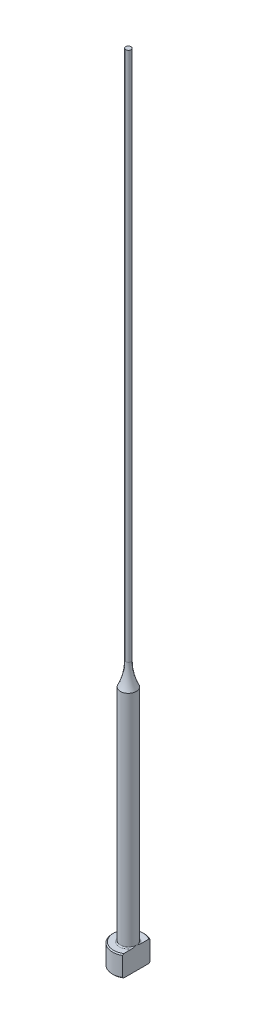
ISO-10303-21;
HEADER;
FILE_DESCRIPTION(('STEP AP214'),'2;1');
FILE_NAME('part.step','',(''),(''),'','','');
FILE_SCHEMA(('AUTOMOTIVE_DESIGN { 1 0 10303 214 1 1 1 1 }'));
ENDSEC;
DATA;
#1=APPLICATION_CONTEXT('core data for automotive mechanical design processes');
#2=APPLICATION_PROTOCOL_DEFINITION('international standard','automotive_design',2000,#1);
#3=PRODUCT_CONTEXT('',#1,'mechanical');
#4=PRODUCT('Part','Part','',(#3));
#5=PRODUCT_RELATED_PRODUCT_CATEGORY('part','',(#4));
#6=PRODUCT_DEFINITION_FORMATION('','',#4);
#7=PRODUCT_DEFINITION_CONTEXT('part definition',#1,'design');
#8=PRODUCT_DEFINITION('design','',#6,#7);
#9=PRODUCT_DEFINITION_SHAPE('','',#8);
#10=(LENGTH_UNIT() NAMED_UNIT(*) SI_UNIT(.MILLI.,.METRE.));
#11=(NAMED_UNIT(*) PLANE_ANGLE_UNIT() SI_UNIT($,.RADIAN.));
#12=(NAMED_UNIT(*) SI_UNIT($,.STERADIAN.) SOLID_ANGLE_UNIT());
#13=UNCERTAINTY_MEASURE_WITH_UNIT(LENGTH_MEASURE(1.E-05),#10,'distance_accuracy_value','');
#14=(GEOMETRIC_REPRESENTATION_CONTEXT(3) GLOBAL_UNCERTAINTY_ASSIGNED_CONTEXT((#13)) GLOBAL_UNIT_ASSIGNED_CONTEXT((#10,
#11,#12)) REPRESENTATION_CONTEXT('',''));
#15=CARTESIAN_POINT('',(0.,0.,0.));
#16=DIRECTION('',(0.,0.,1.));
#17=DIRECTION('',(1.,0.,0.));
#18=AXIS2_PLACEMENT_3D('',#15,#16,#17);
#19=CARTESIAN_POINT('',(-2.99999999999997,4.,0.));
#20=DIRECTION('',(0.,1.,0.));
#21=DIRECTION('',(0.,0.,1.));
#22=AXIS2_PLACEMENT_3D('',#19,#20,#21);
#23=PLANE('',#22);
#24=CARTESIAN_POINT('',(0.,4.,0.));
#25=DIRECTION('',(0.,1.,0.));
#26=DIRECTION('',(0.,0.,1.));
#27=AXIS2_PLACEMENT_3D('',#24,#25,#26);
#28=CIRCLE('',#27,2.79999999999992);
#29=CARTESIAN_POINT('',(1.49999999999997,4.,-2.3643180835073));
#30=VERTEX_POINT('',#29);
#31=CARTESIAN_POINT('',(1.49999999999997,4.,2.3643180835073));
#32=VERTEX_POINT('',#31);
#33=EDGE_CURVE('E187',#30,#32,#28,.T.);
#34=ORIENTED_EDGE('',*,*,#33,.T.);
#35=DIRECTION('',(0.,0.,-1.));
#36=VECTOR('',#35,1.);
#37=CARTESIAN_POINT('',(1.49999999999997,4.,0.));
#38=LINE('',#37,#36);
#39=CARTESIAN_POINT('',(1.49999999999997,3.99999999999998,0.799999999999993));
#40=VERTEX_POINT('',#39);
#41=EDGE_CURVE('E57',#32,#40,#38,.T.);
#42=ORIENTED_EDGE('',*,*,#41,.T.);
#43=CARTESIAN_POINT('',(0.,4.,0.));
#44=DIRECTION('',(0.,1.,0.));
#45=DIRECTION('',(0.,0.,1.));
#46=AXIS2_PLACEMENT_3D('',#43,#44,#45);
#47=CIRCLE('',#46,1.69999999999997);
#48=CARTESIAN_POINT('',(1.49999999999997,3.99999999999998,-0.799999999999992));
#49=VERTEX_POINT('',#48);
#50=EDGE_CURVE('E108',#40,#49,#47,.F.);
#51=ORIENTED_EDGE('',*,*,#50,.T.);
#52=EDGE_CURVE('E137',#49,#30,#38,.T.);
#53=ORIENTED_EDGE('',*,*,#52,.T.);
#54=EDGE_LOOP('',(#34,#42,#51,#53));
#55=FACE_BOUND('',#54,.T.);
#56=ADVANCED_FACE('F32',(#55),#23,.T.);
#57=CARTESIAN_POINT('',(0.,259.958771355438,0.));
#58=DIRECTION('',(0.,1.,0.));
#59=DIRECTION('',(0.,0.,1.));
#60=AXIS2_PLACEMENT_3D('',#57,#58,#59);
#61=CYLINDRICAL_SURFACE('',#60,2.99999999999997);
#62=CARTESIAN_POINT('',(0.,3.79999999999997,0.));
#63=DIRECTION('',(0.,1.,0.));
#64=DIRECTION('',(0.,0.,1.));
#65=AXIS2_PLACEMENT_3D('',#62,#63,#64);
#66=CIRCLE('',#65,2.99999999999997);
#67=CARTESIAN_POINT('',(1.49999999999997,3.79999999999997,2.5980762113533));
#68=VERTEX_POINT('',#67);
#69=CARTESIAN_POINT('',(1.49999999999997,3.79999999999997,-2.5980762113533));
#70=VERTEX_POINT('',#69);
#71=EDGE_CURVE('E105',#68,#70,#66,.F.);
#72=ORIENTED_EDGE('',*,*,#71,.T.);
#73=DIRECTION('',(0.,-1.,0.));
#74=VECTOR('',#73,1.);
#75=CARTESIAN_POINT('',(1.49999999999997,150.,-2.5980762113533));
#76=LINE('',#75,#74);
#77=CARTESIAN_POINT('',(1.49999999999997,0.199999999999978,-2.5980762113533));
#78=VERTEX_POINT('',#77);
#79=EDGE_CURVE('E193',#70,#78,#76,.T.);
#80=ORIENTED_EDGE('',*,*,#79,.T.);
#81=CARTESIAN_POINT('',(0.,0.199999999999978,0.));
#82=DIRECTION('',(0.,-1.,0.));
#83=DIRECTION('',(0.,0.,-1.));
#84=AXIS2_PLACEMENT_3D('',#81,#82,#83);
#85=CIRCLE('',#84,2.99999999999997);
#86=CARTESIAN_POINT('',(1.49999999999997,0.199999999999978,2.5980762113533));
#87=VERTEX_POINT('',#86);
#88=EDGE_CURVE('E100',#78,#87,#85,.F.);
#89=ORIENTED_EDGE('',*,*,#88,.T.);
#90=DIRECTION('',(0.,-1.,0.));
#91=VECTOR('',#90,1.);
#92=CARTESIAN_POINT('',(1.49999999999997,150.,2.5980762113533));
#93=LINE('',#92,#91);
#94=EDGE_CURVE('E93',#68,#87,#93,.T.);
#95=ORIENTED_EDGE('',*,*,#94,.F.);
#96=EDGE_LOOP('',(#72,#80,#89,#95));
#97=FACE_BOUND('',#96,.T.);
#98=ADVANCED_FACE('F158',(#97),#61,.T.);
#99=CARTESIAN_POINT('',(0.,0.,0.));
#100=DIRECTION('',(0.,-1.,0.));
#101=DIRECTION('',(0.,0.,-1.));
#102=AXIS2_PLACEMENT_3D('',#99,#100,#101);
#103=PLANE('',#102);
#104=CARTESIAN_POINT('',(0.,0.,0.));
#105=DIRECTION('',(0.,-1.,0.));
#106=DIRECTION('',(0.,0.,-1.));
#107=AXIS2_PLACEMENT_3D('',#104,#105,#106);
#108=CIRCLE('',#107,2.8);
#109=CARTESIAN_POINT('',(1.49999999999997,0.,2.36431808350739));
#110=VERTEX_POINT('',#109);
#111=CARTESIAN_POINT('',(1.49999999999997,0.,-2.36431808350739));
#112=VERTEX_POINT('',#111);
#113=EDGE_CURVE('E98',#110,#112,#108,.T.);
#114=ORIENTED_EDGE('',*,*,#113,.T.);
#115=DIRECTION('',(0.,0.,1.));
#116=VECTOR('',#115,1.);
#117=CARTESIAN_POINT('',(1.49999999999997,0.,2.5980762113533));
#118=LINE('',#117,#116);
#119=EDGE_CURVE('E83',#112,#110,#118,.T.);
#120=ORIENTED_EDGE('',*,*,#119,.T.);
#121=EDGE_LOOP('',(#114,#120));
#122=FACE_BOUND('',#121,.T.);
#123=ADVANCED_FACE('F103',(#122),#103,.T.);
#124=CARTESIAN_POINT('',(0.,4.,0.));
#125=DIRECTION('',(0.,-1.,0.));
#126=DIRECTION('',(0.,0.,-1.));
#127=AXIS2_PLACEMENT_3D('',#124,#125,#126);
#128=CONICAL_SURFACE('',#127,2.79999999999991,0.7853981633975);
#129=ORIENTED_EDGE('',*,*,#71,.F.);
#130=CARTESIAN_POINT('',(1.49999999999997,0.888258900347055,5.71827621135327));
#131=CARTESIAN_POINT('',(1.49999999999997,1.01361833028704,5.58866816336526));
#132=CARTESIAN_POINT('',(1.49999999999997,1.13884324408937,5.45892957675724));
#133=CARTESIAN_POINT('',(1.49999999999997,1.38894444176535,5.19911365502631));
#134=CARTESIAN_POINT('',(1.49999999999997,1.51382072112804,5.06903631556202));
#135=CARTESIAN_POINT('',(1.49999999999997,1.76320568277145,4.8084018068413));
#136=CARTESIAN_POINT('',(1.49999999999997,1.88771414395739,4.67784442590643));
#137=CARTESIAN_POINT('',(1.49999999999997,2.13618059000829,4.41620813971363));
#138=CARTESIAN_POINT('',(1.49999999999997,2.26013857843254,4.28512923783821));
#139=CARTESIAN_POINT('',(1.49999999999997,2.50488975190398,4.02490837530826));
#140=CARTESIAN_POINT('',(1.49999999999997,2.62569693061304,3.89577958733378));
#141=CARTESIAN_POINT('',(1.49999999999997,2.86640694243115,3.63668213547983));
#142=CARTESIAN_POINT('',(1.49999999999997,2.98630978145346,3.5067134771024));
#143=CARTESIAN_POINT('',(1.49999999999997,3.22486033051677,3.24567921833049));
#144=CARTESIAN_POINT('',(1.49999999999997,3.34350830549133,3.11461386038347));
#145=CARTESIAN_POINT('',(1.49999999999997,3.57907716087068,2.85094268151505));
#146=CARTESIAN_POINT('',(1.49999999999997,3.69599811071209,2.71833692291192));
#147=CARTESIAN_POINT('',(1.49999999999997,3.88262371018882,2.50255231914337));
#148=CARTESIAN_POINT('',(1.49999999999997,3.95312454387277,2.42006293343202));
#149=CARTESIAN_POINT('',(1.49999999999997,4.09287098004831,2.25401084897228));
#150=CARTESIAN_POINT('',(1.49999999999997,4.16211645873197,2.17044804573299));
#151=CARTESIAN_POINT('',(1.49999999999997,4.29964684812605,2.00105967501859));
#152=CARTESIAN_POINT('',(1.49999999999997,4.36791386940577,1.91521952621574));
#153=CARTESIAN_POINT('',(1.49999999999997,4.50205840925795,1.74171392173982));
#154=CARTESIAN_POINT('',(1.49999999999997,4.56793649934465,1.65404891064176));
#155=CARTESIAN_POINT('',(1.49999999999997,4.69728151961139,1.47490236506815));
#156=CARTESIAN_POINT('',(1.49999999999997,4.76069661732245,1.38338308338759));
#157=CARTESIAN_POINT('',(1.49999999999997,4.88239539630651,1.1967566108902));
#158=CARTESIAN_POINT('',(1.49999999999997,4.9406720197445,1.10164473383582));
#159=CARTESIAN_POINT('',(1.49999999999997,5.04841325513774,0.908008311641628));
#160=CARTESIAN_POINT('',(1.49999999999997,5.09797809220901,0.809540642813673));
#161=CARTESIAN_POINT('',(1.49999999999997,5.18432188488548,0.607192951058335));
#162=CARTESIAN_POINT('',(1.49999999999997,5.22114374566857,0.503332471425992));
#163=CARTESIAN_POINT('',(1.49999999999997,5.26099935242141,0.347577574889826));
#164=CARTESIAN_POINT('',(1.49999999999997,5.27157029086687,0.297609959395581));
#165=CARTESIAN_POINT('',(1.49999999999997,5.28794860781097,0.196885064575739));
#166=CARTESIAN_POINT('',(1.49999999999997,5.29375640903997,0.146127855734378));
#167=CARTESIAN_POINT('',(1.49999999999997,5.3001970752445,0.0444388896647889));
#168=CARTESIAN_POINT('',(1.49999999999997,5.3008459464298,-0.00649183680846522));
#169=CARTESIAN_POINT('',(1.49999999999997,5.29696416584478,-0.108155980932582));
#170=CARTESIAN_POINT('',(1.49999999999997,5.29243308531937,-0.158889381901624));
#171=CARTESIAN_POINT('',(1.49999999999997,5.2785691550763,-0.259234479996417));
#172=CARTESIAN_POINT('',(1.49999999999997,5.2692782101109,-0.308852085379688));
#173=CARTESIAN_POINT('',(1.49999999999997,5.24647108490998,-0.40711049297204));
#174=CARTESIAN_POINT('',(1.49999999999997,5.23295324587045,-0.455750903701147));
#175=CARTESIAN_POINT('',(1.49999999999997,5.20226175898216,-0.552149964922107));
#176=CARTESIAN_POINT('',(1.49999999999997,5.18506801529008,-0.5999021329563));
#177=CARTESIAN_POINT('',(1.49999999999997,5.14771387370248,-0.694205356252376));
#178=CARTESIAN_POINT('',(1.49999999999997,5.12755408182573,-0.740756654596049));
#179=CARTESIAN_POINT('',(1.49999999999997,5.06327696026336,-0.879166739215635));
#180=CARTESIAN_POINT('',(1.49999999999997,5.01551721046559,-0.969329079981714));
#181=CARTESIAN_POINT('',(1.49999999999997,4.91367909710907,-1.1460431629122));
#182=CARTESIAN_POINT('',(1.49999999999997,4.85959300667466,-1.23259031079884));
#183=CARTESIAN_POINT('',(1.49999999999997,4.74697968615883,-1.40321348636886));
#184=CARTESIAN_POINT('',(1.49999999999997,4.68843573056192,-1.48727838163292));
#185=CARTESIAN_POINT('',(1.49999999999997,4.56843845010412,-1.6532218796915));
#186=CARTESIAN_POINT('',(1.49999999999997,4.50698656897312,-1.73510153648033));
#187=CARTESIAN_POINT('',(1.49999999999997,4.38115673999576,-1.89829823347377));
#188=CARTESIAN_POINT('',(1.49999999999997,4.31675092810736,-1.9795936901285));
#189=CARTESIAN_POINT('',(1.49999999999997,4.18634068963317,-2.14090082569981));
#190=CARTESIAN_POINT('',(1.49999999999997,4.12033609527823,-2.22091236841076));
#191=CARTESIAN_POINT('',(1.49999999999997,3.92086431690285,-2.45906508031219));
#192=CARTESIAN_POINT('',(1.49999999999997,3.78562663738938,-2.61572090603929));
#193=CARTESIAN_POINT('',(1.49999999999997,3.53554498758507,-2.90006295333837));
#194=CARTESIAN_POINT('',(1.49999999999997,3.42114543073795,-3.02814382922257));
#195=CARTESIAN_POINT('',(1.49999999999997,3.19093557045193,-3.28303767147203));
#196=CARTESIAN_POINT('',(1.49999999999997,3.07512522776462,-3.40985060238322));
#197=CARTESIAN_POINT('',(1.49999999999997,2.72597067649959,-3.78913849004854));
#198=CARTESIAN_POINT('',(1.49999999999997,2.49111760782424,-4.04022177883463));
#199=CARTESIAN_POINT('',(1.49999999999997,2.02882478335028,-4.52992803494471));
#200=CARTESIAN_POINT('',(1.49999999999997,1.80147747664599,-4.76863870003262));
#201=CARTESIAN_POINT('',(1.49999999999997,1.45954865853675,-5.12558036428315));
#202=CARTESIAN_POINT('',(1.49999999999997,1.34548484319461,-5.24430773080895));
#203=CARTESIAN_POINT('',(1.49999999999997,1.11707176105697,-5.48148573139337));
#204=CARTESIAN_POINT('',(1.49999999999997,1.00272249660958,-5.59993636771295));
#205=CARTESIAN_POINT('',(1.49999999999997,0.888258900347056,-5.71827621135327));
#206=B_SPLINE_CURVE_WITH_KNOTS('',3,(#130,#131,#132,#133,#134,#135,#136,#137,#138,#139,#140,
#141,#142,#143,#144,#145,#146,#147,#148,#149,#150,#151,#152,#153,#154,#155,#156,#157,#158,#159,
#160,#161,#162,#163,#164,#165,#166,#167,#168,#169,#170,#171,#172,#173,#174,#175,#176,#177,#178,
#179,#180,#181,#182,#183,#184,#185,#186,#187,#188,#189,#190,#191,#192,#193,#194,#195,#196,#197,
#198,#199,#200,#201,#202,#203,#204,#205),.UNSPECIFIED.,.F.,.F.,(4,2,2,2,2,2,2,2,2,2,2,2,2,2,2,2,
2,2,2,2,2,2,2,2,2,2,2,2,2,2,2,2,2,2,2,2,2,4),(0.,0.540943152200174,1.08189327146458,
1.62312052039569,2.16434426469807,2.69482920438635,3.22531067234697,3.75567781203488,
4.28602356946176,4.61155053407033,4.93710943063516,5.26610945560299,5.59503024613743,
5.92894782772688,6.26331713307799,6.59354403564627,6.92264800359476,7.07567478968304,
7.22868799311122,7.38122626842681,7.53377717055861,7.68500755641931,7.83629736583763,
7.98843643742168,8.14054446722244,8.4461879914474,8.75220879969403,9.05944044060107,
9.366521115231,9.677642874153,9.98879742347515,10.6095925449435,11.1247803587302,
11.6399825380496,12.6713544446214,13.6603005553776,14.1542238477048,14.648143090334),.UNSPECIFIED.);
#207=EDGE_CURVE('E136',#68,#32,#206,.T.);
#208=ORIENTED_EDGE('',*,*,#207,.T.);
#209=ORIENTED_EDGE('',*,*,#33,.F.);
#210=EDGE_CURVE('E128',#30,#70,#206,.T.);
#211=ORIENTED_EDGE('',*,*,#210,.T.);
#212=EDGE_LOOP('',(#129,#208,#209,#211));
#213=FACE_BOUND('',#212,.T.);
#214=ADVANCED_FACE('F144',(#213),#128,.T.);
#215=CARTESIAN_POINT('',(0.,0.199999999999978,0.));
#216=DIRECTION('',(0.,1.,0.));
#217=DIRECTION('',(0.,0.,1.));
#218=AXIS2_PLACEMENT_3D('',#215,#216,#217);
#219=CONICAL_SURFACE('',#218,2.99999999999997,0.785398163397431);
#220=ORIENTED_EDGE('',*,*,#88,.F.);
#221=CARTESIAN_POINT('',(1.49999999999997,3.1117410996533,-5.71827621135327));
#222=CARTESIAN_POINT('',(1.49999999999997,2.98638166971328,-5.58866816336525));
#223=CARTESIAN_POINT('',(1.49999999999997,2.86115675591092,-5.45892957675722));
#224=CARTESIAN_POINT('',(1.49999999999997,2.61105555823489,-5.19911365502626));
#225=CARTESIAN_POINT('',(1.49999999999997,2.48617927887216,-5.06903631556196));
#226=CARTESIAN_POINT('',(1.49999999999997,2.23679431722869,-4.80840180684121));
#227=CARTESIAN_POINT('',(1.49999999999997,2.11228585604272,-4.67784442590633));
#228=CARTESIAN_POINT('',(1.49999999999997,1.86381940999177,-4.4162081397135));
#229=CARTESIAN_POINT('',(1.49999999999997,1.73986142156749,-4.28512923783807));
#230=CARTESIAN_POINT('',(1.49999999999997,1.49511024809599,-4.02490837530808));
#231=CARTESIAN_POINT('',(1.49999999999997,1.3743030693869,-3.8957795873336));
#232=CARTESIAN_POINT('',(1.49999999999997,1.13359305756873,-3.63668213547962));
#233=CARTESIAN_POINT('',(1.49999999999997,1.0136902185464,-3.50671347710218));
#234=CARTESIAN_POINT('',(1.49999999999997,0.77513966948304,-3.24567921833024));
#235=CARTESIAN_POINT('',(1.49999999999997,0.656491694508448,-3.11461386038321));
#236=CARTESIAN_POINT('',(1.49999999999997,0.420922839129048,-2.85094268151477));
#237=CARTESIAN_POINT('',(1.49999999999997,0.30400188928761,-2.71833692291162));
#238=CARTESIAN_POINT('',(1.49999999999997,0.11737628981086,-2.50255231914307));
#239=CARTESIAN_POINT('',(1.49999999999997,0.046875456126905,-2.42006293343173));
#240=CARTESIAN_POINT('',(1.49999999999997,-0.0928709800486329,-2.254010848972));
#241=CARTESIAN_POINT('',(1.49999999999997,-0.162116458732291,-2.17044804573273));
#242=CARTESIAN_POINT('',(1.49999999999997,-0.299646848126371,-2.00105967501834));
#243=CARTESIAN_POINT('',(1.49999999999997,-0.367913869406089,-1.9152195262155));
#244=CARTESIAN_POINT('',(1.49999999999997,-0.502058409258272,-1.7417139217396));
#245=CARTESIAN_POINT('',(1.49999999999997,-0.567936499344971,-1.65404891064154));
#246=CARTESIAN_POINT('',(1.49999999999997,-0.697281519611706,-1.47490236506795));
#247=CARTESIAN_POINT('',(1.49999999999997,-0.76069661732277,-1.38338308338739));
#248=CARTESIAN_POINT('',(1.49999999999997,-0.882395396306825,-1.19675661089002));
#249=CARTESIAN_POINT('',(1.49999999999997,-0.940672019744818,-1.10164473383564));
#250=CARTESIAN_POINT('',(1.49999999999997,-1.04841325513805,-0.908008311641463));
#251=CARTESIAN_POINT('',(1.49999999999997,-1.09797809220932,-0.809540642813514));
#252=CARTESIAN_POINT('',(1.49999999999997,-1.18432188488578,-0.607192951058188));
#253=CARTESIAN_POINT('',(1.49999999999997,-1.22114374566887,-0.50333247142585));
#254=CARTESIAN_POINT('',(1.49999999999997,-1.26099935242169,-0.347577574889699));
#255=CARTESIAN_POINT('',(1.49999999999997,-1.27157029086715,-0.297609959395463));
#256=CARTESIAN_POINT('',(1.49999999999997,-1.28794860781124,-0.196885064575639));
#257=CARTESIAN_POINT('',(1.49999999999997,-1.29375640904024,-0.146127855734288));
#258=CARTESIAN_POINT('',(1.49999999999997,-1.30019707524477,-0.0444388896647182));
#259=CARTESIAN_POINT('',(1.49999999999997,-1.30084594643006,0.00649183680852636));
#260=CARTESIAN_POINT('',(1.49999999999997,-1.29696416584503,0.108155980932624));
#261=CARTESIAN_POINT('',(1.49999999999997,-1.29243308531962,0.158889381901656));
#262=CARTESIAN_POINT('',(1.49999999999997,-1.27856915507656,0.25923447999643));
#263=CARTESIAN_POINT('',(1.49999999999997,-1.26927821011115,0.308852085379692));
#264=CARTESIAN_POINT('',(1.49999999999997,-1.24647108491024,0.407110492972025));
#265=CARTESIAN_POINT('',(1.49999999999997,-1.2329532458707,0.455750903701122));
#266=CARTESIAN_POINT('',(1.49999999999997,-1.20226175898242,0.552149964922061));
#267=CARTESIAN_POINT('',(1.49999999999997,-1.18506801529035,0.599902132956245));
#268=CARTESIAN_POINT('',(1.49999999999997,-1.14771387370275,0.694205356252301));
#269=CARTESIAN_POINT('',(1.49999999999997,-1.12755408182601,0.740756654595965));
#270=CARTESIAN_POINT('',(1.49999999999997,-1.06327696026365,0.879166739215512));
#271=CARTESIAN_POINT('',(1.49999999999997,-1.0155172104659,0.969329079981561));
#272=CARTESIAN_POINT('',(1.49999999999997,-0.913679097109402,1.14604316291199));
#273=CARTESIAN_POINT('',(1.49999999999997,-0.859593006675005,1.2325903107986));
#274=CARTESIAN_POINT('',(1.49999999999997,-0.746979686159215,1.40321348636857));
#275=CARTESIAN_POINT('',(1.49999999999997,-0.688435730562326,1.4872783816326));
#276=CARTESIAN_POINT('',(1.49999999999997,-0.568438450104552,1.65322187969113));
#277=CARTESIAN_POINT('',(1.49999999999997,-0.506986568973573,1.73510153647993));
#278=CARTESIAN_POINT('',(1.49999999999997,-0.381156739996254,1.89829823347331));
#279=CARTESIAN_POINT('',(1.49999999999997,-0.316750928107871,1.97959369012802));
#280=CARTESIAN_POINT('',(1.49999999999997,-0.18634068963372,2.14090082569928));
#281=CARTESIAN_POINT('',(1.49999999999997,-0.120336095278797,2.22091236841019));
#282=CARTESIAN_POINT('',(1.49999999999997,0.0791356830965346,2.45906508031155));
#283=CARTESIAN_POINT('',(1.49999999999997,0.214373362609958,2.61572090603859));
#284=CARTESIAN_POINT('',(1.49999999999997,0.464455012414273,2.90006295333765));
#285=CARTESIAN_POINT('',(1.49999999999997,0.578854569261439,3.02814382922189));
#286=CARTESIAN_POINT('',(1.49999999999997,0.809064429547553,3.28303767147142));
#287=CARTESIAN_POINT('',(1.49999999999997,0.924874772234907,3.40985060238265));
#288=CARTESIAN_POINT('',(1.49999999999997,1.27402932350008,3.78913849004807));
#289=CARTESIAN_POINT('',(1.49999999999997,1.50888239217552,4.04022177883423));
#290=CARTESIAN_POINT('',(1.49999999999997,1.97117521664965,4.52992803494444));
#291=CARTESIAN_POINT('',(1.49999999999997,2.19852252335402,4.76863870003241));
#292=CARTESIAN_POINT('',(1.49999999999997,2.54045134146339,5.12558036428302));
#293=CARTESIAN_POINT('',(1.49999999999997,2.65451515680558,5.24430773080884));
#294=CARTESIAN_POINT('',(1.49999999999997,2.8829282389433,5.48148573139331));
#295=CARTESIAN_POINT('',(1.49999999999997,2.99727750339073,5.59993636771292));
#296=CARTESIAN_POINT('',(1.49999999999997,3.1117410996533,5.71827621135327));
#297=B_SPLINE_CURVE_WITH_KNOTS('',3,(#221,#222,#223,#224,#225,#226,#227,#228,#229,#230,#231,
#232,#233,#234,#235,#236,#237,#238,#239,#240,#241,#242,#243,#244,#245,#246,#247,#248,#249,#250,
#251,#252,#253,#254,#255,#256,#257,#258,#259,#260,#261,#262,#263,#264,#265,#266,#267,#268,#269,
#270,#271,#272,#273,#274,#275,#276,#277,#278,#279,#280,#281,#282,#283,#284,#285,#286,#287,#288,
#289,#290,#291,#292,#293,#294,#295,#296),.UNSPECIFIED.,.F.,.F.,(4,2,2,2,2,2,2,2,2,2,2,2,2,2,2,2,
2,2,2,2,2,2,2,2,2,2,2,2,2,2,2,2,2,2,2,2,2,4),(0.,0.540943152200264,1.08189327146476,
1.62312052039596,2.16434426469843,2.69482920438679,3.22531067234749,3.75567781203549,
4.28602356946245,4.611550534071,4.9371094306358,5.26610945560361,5.59503024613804,
5.92894782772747,6.26331713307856,6.59354403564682,6.92264800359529,7.07567478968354,
7.22868799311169,7.38122626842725,7.53377717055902,7.6850075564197,7.83629736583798,
7.98843643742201,8.14054446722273,8.44618799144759,8.75220879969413,9.05944044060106,
9.3665211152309,9.6776428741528,9.98879742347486,10.609592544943,11.1247803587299,
11.6399825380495,12.6713544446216,13.6603005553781,14.1542238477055,14.6481430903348),.UNSPECIFIED.);
#298=EDGE_CURVE('E86',#78,#112,#297,.T.);
#299=ORIENTED_EDGE('',*,*,#298,.T.);
#300=ORIENTED_EDGE('',*,*,#113,.F.);
#301=EDGE_CURVE('E89',#110,#87,#297,.T.);
#302=ORIENTED_EDGE('',*,*,#301,.T.);
#303=EDGE_LOOP('',(#220,#299,#300,#302));
#304=FACE_BOUND('',#303,.T.);
#305=ADVANCED_FACE('F97',(#304),#219,.T.);
#306=CARTESIAN_POINT('',(0.,4.19999999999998,0.));
#307=DIRECTION('',(0.,1.,0.));
#308=DIRECTION('',(0.,0.,1.));
#309=AXIS2_PLACEMENT_3D('',#306,#307,#308);
#310=TOROIDAL_SURFACE('',#309,1.69999999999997,0.2);
#311=CARTESIAN_POINT('',(1.49999999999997,4.19999999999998,0.));
#312=CARTESIAN_POINT('',(1.49999999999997,4.20000050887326,7.14686674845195E-11));
#313=CARTESIAN_POINT('',(1.49999999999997,4.20000101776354,-1.21663673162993E-07));
#314=CARTESIAN_POINT('',(1.49999999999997,4.20000199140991,-4.97616237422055E-07));
#315=CARTESIAN_POINT('',(1.49999999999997,4.20000245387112,-7.56516220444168E-07));
#316=CARTESIAN_POINT('',(1.49999999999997,4.20000338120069,-1.37642837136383E-06));
#317=CARTESIAN_POINT('',(1.49999999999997,4.20000384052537,-1.74563476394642E-06));
#318=CARTESIAN_POINT('',(1.49999999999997,4.20000469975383,-2.53565984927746E-06));
#319=CARTESIAN_POINT('',(1.49999999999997,4.20000510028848,-2.95582597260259E-06));
#320=CARTESIAN_POINT('',(1.49999999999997,4.20000646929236,-4.48430445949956E-06));
#321=CARTESIAN_POINT('',(1.49999999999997,4.20000736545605,-5.6586103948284E-06));
#322=CARTESIAN_POINT('',(1.49999999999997,4.20000893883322,-8.06479202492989E-06));
#323=CARTESIAN_POINT('',(1.49999999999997,4.20000962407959,-9.29170517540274E-06));
#324=CARTESIAN_POINT('',(1.49999999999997,4.20001225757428,-1.416232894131E-05));
#325=CARTESIAN_POINT('',(1.49999999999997,4.20001407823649,-1.78790031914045E-05));
#326=CARTESIAN_POINT('',(1.49999999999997,4.20001699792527,-2.51443066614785E-05));
#327=CARTESIAN_POINT('',(1.49999999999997,4.20001815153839,-2.86715394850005E-05));
#328=CARTESIAN_POINT('',(1.49999999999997,4.20002315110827,-4.39218128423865E-05));
#329=CARTESIAN_POINT('',(1.49999999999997,4.20002701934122,-5.56288390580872E-05));
#330=CARTESIAN_POINT('',(1.49999999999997,4.20003312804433,-7.7405829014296E-05));
#331=CARTESIAN_POINT('',(1.49999999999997,4.20003553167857,-8.74278412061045E-05));
#332=CARTESIAN_POINT('',(1.49999999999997,4.20005483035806,-0.000161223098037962));
#333=CARTESIAN_POINT('',(1.49999999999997,4.20007979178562,-0.000222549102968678));
#334=CARTESIAN_POINT('',(1.49999999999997,4.20017391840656,-0.000462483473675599));
#335=CARTESIAN_POINT('',(1.49999999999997,4.20023706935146,-0.000642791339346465));
#336=CARTESIAN_POINT('',(1.49999999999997,4.20048761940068,-0.00134785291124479));
#337=CARTESIAN_POINT('',(1.49999999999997,4.20068132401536,-0.00187087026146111));
#338=CARTESIAN_POINT('',(1.49999999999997,4.20147357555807,-0.00402004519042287));
#339=CARTESIAN_POINT('',(1.49999999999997,4.20206499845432,-0.0056481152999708));
#340=CARTESIAN_POINT('',(1.49999999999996,4.20892634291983,-0.0245232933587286));
#341=CARTESIAN_POINT('',(1.49999999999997,4.21523683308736,-0.041759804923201));
#342=CARTESIAN_POINT('',(1.49999999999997,4.22755028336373,-0.0756091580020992));
#343=CARTESIAN_POINT('',(1.49999999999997,4.23355589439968,-0.0922211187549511));
#344=CARTESIAN_POINT('',(1.49999999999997,4.24620101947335,-0.127454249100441));
#345=CARTESIAN_POINT('',(1.49999999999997,4.25283080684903,-0.146078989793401));
#346=CARTESIAN_POINT('',(1.49999999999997,4.26599765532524,-0.183577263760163));
#347=CARTESIAN_POINT('',(1.49999999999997,4.27253305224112,-0.202451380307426));
#348=CARTESIAN_POINT('',(1.49999999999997,4.28834228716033,-0.248982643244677));
#349=CARTESIAN_POINT('',(1.49999999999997,4.2974915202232,-0.276682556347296));
#350=CARTESIAN_POINT('',(1.49999999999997,4.31490935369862,-0.331625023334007));
#351=CARTESIAN_POINT('',(1.49999999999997,4.3231938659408,-0.358862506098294));
#352=CARTESIAN_POINT('',(1.49999999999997,4.34051594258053,-0.419125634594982));
#353=CARTESIAN_POINT('',(1.49999999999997,4.34936607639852,-0.452206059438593));
#354=CARTESIAN_POINT('',(1.49999999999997,4.36549583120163,-0.519023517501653));
#355=CARTESIAN_POINT('',(1.49999999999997,4.37276283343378,-0.552763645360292));
#356=CARTESIAN_POINT('',(1.49999999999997,4.38554755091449,-0.62305310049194));
#357=CARTESIAN_POINT('',(1.49999999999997,4.39090573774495,-0.65963271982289));
#358=CARTESIAN_POINT('',(1.49999999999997,4.39825016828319,-0.733028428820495));
#359=CARTESIAN_POINT('',(1.49999999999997,4.40024734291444,-0.76984335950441));
#360=CARTESIAN_POINT('',(1.49999999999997,4.39970780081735,-0.842856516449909));
#361=CARTESIAN_POINT('',(1.49999999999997,4.39725347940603,-0.879053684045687));
#362=CARTESIAN_POINT('',(1.49999999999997,4.38900085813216,-0.93238076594));
#363=CARTESIAN_POINT('',(1.49999999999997,4.38553049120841,-0.949868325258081));
#364=CARTESIAN_POINT('',(1.49999999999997,4.37678336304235,-0.984374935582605));
#365=CARTESIAN_POINT('',(1.49999999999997,4.37150943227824,-1.00139467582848));
#366=CARTESIAN_POINT('',(1.49999999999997,4.35869781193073,-1.03479423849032));
#367=CARTESIAN_POINT('',(1.49999999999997,4.3511359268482,-1.05116499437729));
#368=CARTESIAN_POINT('',(1.49999999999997,4.33325333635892,-1.08234828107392));
#369=CARTESIAN_POINT('',(1.49999999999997,4.32294266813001,-1.09716621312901));
#370=CARTESIAN_POINT('',(1.49999999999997,4.30512758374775,-1.11714173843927));
#371=CARTESIAN_POINT('',(1.49999999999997,4.29884721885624,-1.12339066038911));
#372=CARTESIAN_POINT('',(1.49999999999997,4.28545950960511,-1.13494695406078));
#373=CARTESIAN_POINT('',(1.49999999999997,4.27835226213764,-1.14025443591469));
#374=CARTESIAN_POINT('',(1.49999999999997,4.26325970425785,-1.14967631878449));
#375=CARTESIAN_POINT('',(1.49999999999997,4.25526534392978,-1.15377649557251));
#376=CARTESIAN_POINT('',(1.49999999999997,4.23863207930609,-1.16034952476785));
#377=CARTESIAN_POINT('',(1.49999999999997,4.22999427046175,-1.16282507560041));
#378=CARTESIAN_POINT('',(1.49999999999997,4.21343922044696,-1.16570267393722));
#379=CARTESIAN_POINT('',(1.49999999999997,4.20555896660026,-1.16631687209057));
#380=CARTESIAN_POINT('',(1.49999999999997,4.18982775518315,-1.16602054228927));
#381=CARTESIAN_POINT('',(1.49999999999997,4.18197679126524,-1.16511036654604));
#382=CARTESIAN_POINT('',(1.49999999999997,4.16747846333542,-1.16204446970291));
#383=CARTESIAN_POINT('',(1.49999999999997,4.16079696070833,-1.16004509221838));
#384=CARTESIAN_POINT('',(1.49999999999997,4.14781700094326,-1.15505972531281));
#385=CARTESIAN_POINT('',(1.49999999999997,4.14151862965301,-1.1520735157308));
#386=CARTESIAN_POINT('',(1.49999999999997,4.12690214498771,-1.14387585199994));
#387=CARTESIAN_POINT('',(1.49999999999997,4.11881436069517,-1.13825400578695));
#388=CARTESIAN_POINT('',(1.49999999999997,4.1036444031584,-1.12578441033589));
#389=CARTESIAN_POINT('',(1.49999999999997,4.09656475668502,-1.11893367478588));
#390=CARTESIAN_POINT('',(1.49999999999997,4.08012297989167,-1.10074342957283));
#391=CARTESIAN_POINT('',(1.49999999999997,4.07136543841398,-1.08886044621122));
#392=CARTESIAN_POINT('',(1.49999999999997,4.05578194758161,-1.06392743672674));
#393=CARTESIAN_POINT('',(1.49999999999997,4.0489571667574,-1.05087671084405));
#394=CARTESIAN_POINT('',(1.49999999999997,4.03273856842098,-1.01472307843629));
#395=CARTESIAN_POINT('',(1.49999999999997,4.02486230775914,-0.990945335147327));
#396=CARTESIAN_POINT('',(1.49999999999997,4.01257693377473,-0.94232199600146));
#397=CARTESIAN_POINT('',(1.49999999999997,4.00820590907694,-0.917467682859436));
#398=CARTESIAN_POINT('',(1.49999999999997,4.00229956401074,-0.867912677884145));
#399=CARTESIAN_POINT('',(1.49999999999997,4.0007128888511,-0.843217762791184));
#400=CARTESIAN_POINT('',(1.49999999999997,3.9996723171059,-0.79374605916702));
#401=CARTESIAN_POINT('',(1.49999999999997,4.0002230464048,-0.768969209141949));
#402=CARTESIAN_POINT('',(1.49999999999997,4.00433101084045,-0.696994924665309));
#403=CARTESIAN_POINT('',(1.49999999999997,4.01016976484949,-0.64993124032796));
#404=CARTESIAN_POINT('',(1.49999999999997,4.02567776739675,-0.559166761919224));
#405=CARTESIAN_POINT('',(1.49999999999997,4.03511950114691,-0.515423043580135));
#406=CARTESIAN_POINT('',(1.49999999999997,4.05693059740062,-0.427590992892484));
#407=CARTESIAN_POINT('',(1.49999999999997,4.06936356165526,-0.383518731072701));
#408=CARTESIAN_POINT('',(1.49999999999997,4.09174953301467,-0.310161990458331));
#409=CARTESIAN_POINT('',(1.49999999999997,4.10119843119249,-0.280718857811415));
#410=CARTESIAN_POINT('',(1.49999999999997,4.12060442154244,-0.22234098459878));
#411=CARTESIAN_POINT('',(1.49999999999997,4.13055519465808,-0.193404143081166));
#412=CARTESIAN_POINT('',(1.49999999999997,4.14973721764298,-0.138756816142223));
#413=CARTESIAN_POINT('',(1.49999999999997,4.15893123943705,-0.113033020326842));
#414=CARTESIAN_POINT('',(1.49999999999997,4.17788037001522,-0.0606351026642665));
#415=CARTESIAN_POINT('',(1.49999999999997,4.18764328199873,-0.0339636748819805));
#416=CARTESIAN_POINT('',(1.49999999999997,4.19793548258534,-0.00564657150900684));
#417=CARTESIAN_POINT('',(1.49999999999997,4.19852751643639,-0.00401699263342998));
#418=CARTESIAN_POINT('',(1.49999999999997,4.1993199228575,-0.0018674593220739));
#419=CARTESIAN_POINT('',(1.49999999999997,4.19951319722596,-0.00134559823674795));
#420=CARTESIAN_POINT('',(1.49999999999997,4.19976322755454,-0.000641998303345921));
#421=CARTESIAN_POINT('',(1.49999999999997,4.19982627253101,-0.000461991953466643));
#422=CARTESIAN_POINT('',(1.49999999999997,4.19992025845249,-0.000222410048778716));
#423=CARTESIAN_POINT('',(1.49999999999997,4.19994519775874,-0.000161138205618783));
#424=CARTESIAN_POINT('',(1.49999999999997,4.19996448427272,-8.74039267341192E-05));
#425=CARTESIAN_POINT('',(1.49999999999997,4.19996688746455,-7.73857556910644E-05));
#426=CARTESIAN_POINT('',(1.49999999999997,4.1999729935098,-5.56173272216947E-05));
#427=CARTESIAN_POINT('',(1.49999999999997,4.19997685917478,-4.39149186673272E-05));
#428=CARTESIAN_POINT('',(1.49999999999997,4.19998185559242,-2.86698156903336E-05));
#429=CARTESIAN_POINT('',(1.49999999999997,4.19998300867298,-2.51431575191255E-05));
#430=CARTESIAN_POINT('',(1.49999999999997,4.19998592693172,-1.78789552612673E-05));
#431=CARTESIAN_POINT('',(1.49999999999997,4.19998774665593,-1.41627846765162E-05));
#432=CARTESIAN_POINT('',(1.49999999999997,4.19999037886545,-9.29264488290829E-06));
#433=CARTESIAN_POINT('',(1.49999999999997,4.19999106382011,-8.06577599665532E-06));
#434=CARTESIAN_POINT('',(1.49999999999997,4.19999263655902,-5.65962639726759E-06));
#435=CARTESIAN_POINT('',(1.49999999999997,4.19999353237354,-4.48530466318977E-06));
#436=CARTESIAN_POINT('',(1.49999999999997,4.19999490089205,-2.95673740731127E-06));
#437=CARTESIAN_POINT('',(1.49999999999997,4.1999953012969,-2.53653208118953E-06));
#438=CARTESIAN_POINT('',(1.49999999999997,4.19999616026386,-1.74640525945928E-06));
#439=CARTESIAN_POINT('',(1.49999999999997,4.19999661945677,-1.37713598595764E-06));
#440=CARTESIAN_POINT('',(1.49999999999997,4.19999754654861,-7.57072336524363E-07));
#441=CARTESIAN_POINT('',(1.49999999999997,4.19999800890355,-4.9808738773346E-07));
#442=CARTESIAN_POINT('',(1.49999999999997,4.19999898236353,-1.21927249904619E-07));
#443=CARTESIAN_POINT('',(1.49999999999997,4.19999949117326,-7.14621294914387E-11));
#444=CARTESIAN_POINT('',(1.49999999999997,4.19999999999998,0.));
#445=B_SPLINE_CURVE_WITH_KNOTS('',3,(#311,#312,#313,#314,#315,#316,#317,#318,#319,#320,#321,
#322,#323,#324,#325,#326,#327,#328,#329,#330,#331,#332,#333,#334,#335,#336,#337,#338,#339,#340,
#341,#342,#343,#344,#345,#346,#347,#348,#349,#350,#351,#352,#353,#354,#355,#356,#357,#358,#359,
#360,#361,#362,#363,#364,#365,#366,#367,#368,#369,#370,#371,#372,#373,#374,#375,#376,#377,#378,
#379,#380,#381,#382,#383,#384,#385,#386,#387,#388,#389,#390,#391,#392,#393,#394,#395,#396,#397,
#398,#399,#400,#401,#402,#403,#404,#405,#406,#407,#408,#409,#410,#411,#412,#413,#414,#415,#416,
#417,#418,#419,#420,#421,#422,#423,#424,#425,#426,#427,#428,#429,#430,#431,#432,#433,#434,#435,
#436,#437,#438,#439,#440,#441,#442,#443,#444),.UNSPECIFIED.,.T.,.F.,(4,2,2,2,2,2,2,2,2,2,2,2,2,
2,2,2,2,2,2,2,2,2,2,2,2,2,2,2,2,2,2,2,2,2,2,2,2,2,2,2,2,2,2,2,2,2,2,2,2,2,2,2,2,2,2,2,2,2,2,2,2,
2,2,2,2,2,4),(0.,1.5268750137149E-06,3.10959387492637E-06,4.86976756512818E-06,
6.60940084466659E-06,1.10202525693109E-05,1.5232779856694E-05,2.7614037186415E-05,
3.87351645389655E-05,7.57188332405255E-05,0.000106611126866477,0.000304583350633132,
0.00087827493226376,0.00255078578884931,0.0077480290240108,0.0628090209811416,0.115802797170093,
0.175110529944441,0.23503061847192,0.32253950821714,0.407938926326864,0.510638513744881,
0.614128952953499,0.724918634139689,0.835347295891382,0.943752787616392,0.997165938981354,
1.05049564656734,1.10441029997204,1.15813071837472,1.18463966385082,1.21114550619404,
1.23795217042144,1.26471419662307,1.2882832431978,1.31184684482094,1.33268332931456,
1.35352446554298,1.38290826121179,1.41236445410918,1.45639976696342,1.50046164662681,
1.57518788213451,1.65071550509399,1.72483484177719,1.79911468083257,1.94105061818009,
2.07520625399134,2.2125154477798,2.30527614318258,2.39707056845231,2.47902409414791,
2.56422207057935,2.56942417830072,2.57109299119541,2.57166572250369,2.57186352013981,
2.57189440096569,2.57193136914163,2.57194248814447,2.57195486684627,2.57195907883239,
2.57196348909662,2.57196522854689,2.57196698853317,2.57196857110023,2.57197009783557),.UNSPECIFIED.);
#446=CARTESIAN_POINT('',(1.49999999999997,4.19999999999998,0.));
#447=VERTEX_POINT('',#446);
#448=EDGE_CURVE('E11',#49,#447,#445,.T.);
#449=ORIENTED_EDGE('',*,*,#448,.F.);
#450=ORIENTED_EDGE('',*,*,#50,.F.);
#451=CARTESIAN_POINT('',(1.49999999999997,4.19999999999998,0.));
#452=CARTESIAN_POINT('',(1.49999999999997,4.1999994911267,-7.1468641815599E-11));
#453=CARTESIAN_POINT('',(1.49999999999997,4.19999898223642,1.21663673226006E-07));
#454=CARTESIAN_POINT('',(1.49999999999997,4.19999800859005,4.97616237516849E-07));
#455=CARTESIAN_POINT('',(1.49999999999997,4.19999754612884,7.56516220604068E-07));
#456=CARTESIAN_POINT('',(1.49999999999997,4.19999661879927,1.37642837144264E-06));
#457=CARTESIAN_POINT('',(1.49999999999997,4.1999961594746,1.74563476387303E-06));
#458=CARTESIAN_POINT('',(1.49999999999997,4.19999530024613,2.5356598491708E-06));
#459=CARTESIAN_POINT('',(1.49999999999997,4.19999489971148,2.95582597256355E-06));
#460=CARTESIAN_POINT('',(1.49999999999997,4.1999935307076,4.48430445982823E-06));
#461=CARTESIAN_POINT('',(1.49999999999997,4.19999263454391,5.6586103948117E-06));
#462=CARTESIAN_POINT('',(1.49999999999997,4.19999106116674,8.06479202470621E-06));
#463=CARTESIAN_POINT('',(1.49999999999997,4.19999037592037,9.29170517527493E-06));
#464=CARTESIAN_POINT('',(1.49999999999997,4.19998774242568,1.41623289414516E-05));
#465=CARTESIAN_POINT('',(1.49999999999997,4.19998592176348,1.78790031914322E-05));
#466=CARTESIAN_POINT('',(1.49999999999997,4.1999830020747,2.51443066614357E-05));
#467=CARTESIAN_POINT('',(1.49999999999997,4.19998184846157,2.86715394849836E-05));
#468=CARTESIAN_POINT('',(1.49999999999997,4.1999768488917,4.39218128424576E-05));
#469=CARTESIAN_POINT('',(1.49999999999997,4.19997298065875,5.56288390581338E-05));
#470=CARTESIAN_POINT('',(1.49999999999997,4.19996687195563,7.7405829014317E-05));
#471=CARTESIAN_POINT('',(1.49999999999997,4.19996446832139,8.74278412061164E-05));
#472=CARTESIAN_POINT('',(1.49999999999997,4.1999451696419,0.000161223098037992));
#473=CARTESIAN_POINT('',(1.49999999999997,4.19992020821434,0.000222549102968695));
#474=CARTESIAN_POINT('',(1.49999999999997,4.19982608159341,0.000462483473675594));
#475=CARTESIAN_POINT('',(1.49999999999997,4.1997629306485,0.000642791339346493));
#476=CARTESIAN_POINT('',(1.49999999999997,4.19951238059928,0.00134785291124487));
#477=CARTESIAN_POINT('',(1.49999999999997,4.19931867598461,0.00187087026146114));
#478=CARTESIAN_POINT('',(1.49999999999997,4.19852642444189,0.00402004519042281));
#479=CARTESIAN_POINT('',(1.49999999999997,4.19793500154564,0.00564811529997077));
#480=CARTESIAN_POINT('',(1.49999999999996,4.19107365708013,0.0245232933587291));
#481=CARTESIAN_POINT('',(1.49999999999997,4.1847631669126,0.0417598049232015));
#482=CARTESIAN_POINT('',(1.49999999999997,4.17244971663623,0.0756091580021));
#483=CARTESIAN_POINT('',(1.49999999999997,4.16644410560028,0.0922211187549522));
#484=CARTESIAN_POINT('',(1.49999999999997,4.15379898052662,0.127454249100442));
#485=CARTESIAN_POINT('',(1.49999999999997,4.14716919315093,0.146078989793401));
#486=CARTESIAN_POINT('',(1.49999999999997,4.13400234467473,0.183577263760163));
#487=CARTESIAN_POINT('',(1.49999999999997,4.12746694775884,0.202451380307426));
#488=CARTESIAN_POINT('',(1.49999999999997,4.11165771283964,0.248982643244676));
#489=CARTESIAN_POINT('',(1.49999999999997,4.10250847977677,0.276682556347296));
#490=CARTESIAN_POINT('',(1.49999999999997,4.08509064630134,0.331625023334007));
#491=CARTESIAN_POINT('',(1.49999999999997,4.07680613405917,0.358862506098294));
#492=CARTESIAN_POINT('',(1.49999999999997,4.05948405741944,0.419125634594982));
#493=CARTESIAN_POINT('',(1.49999999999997,4.05063392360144,0.452206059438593));
#494=CARTESIAN_POINT('',(1.49999999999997,4.03450416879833,0.519023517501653));
#495=CARTESIAN_POINT('',(1.49999999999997,4.02723716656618,0.552763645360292));
#496=CARTESIAN_POINT('',(1.49999999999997,4.01445244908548,0.62305310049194));
#497=CARTESIAN_POINT('',(1.49999999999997,4.00909426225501,0.659632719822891));
#498=CARTESIAN_POINT('',(1.49999999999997,4.00174983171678,0.733028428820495));
#499=CARTESIAN_POINT('',(1.49999999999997,3.99975265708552,0.76984335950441));
#500=CARTESIAN_POINT('',(1.49999999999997,4.00029219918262,0.842856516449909));
#501=CARTESIAN_POINT('',(1.49999999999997,4.00274652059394,0.879053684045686));
#502=CARTESIAN_POINT('',(1.49999999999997,4.0109991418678,0.93238076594));
#503=CARTESIAN_POINT('',(1.49999999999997,4.01446950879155,0.949868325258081));
#504=CARTESIAN_POINT('',(1.49999999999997,4.02321663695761,0.984374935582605));
#505=CARTESIAN_POINT('',(1.49999999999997,4.02849056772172,1.00139467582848));
#506=CARTESIAN_POINT('',(1.49999999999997,4.04130218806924,1.03479423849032));
#507=CARTESIAN_POINT('',(1.49999999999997,4.04886407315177,1.05116499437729));
#508=CARTESIAN_POINT('',(1.49999999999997,4.06674666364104,1.08234828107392));
#509=CARTESIAN_POINT('',(1.49999999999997,4.07705733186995,1.09716621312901));
#510=CARTESIAN_POINT('',(1.49999999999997,4.09487241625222,1.11714173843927));
#511=CARTESIAN_POINT('',(1.49999999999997,4.10115278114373,1.12339066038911));
#512=CARTESIAN_POINT('',(1.49999999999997,4.11454049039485,1.13494695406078));
#513=CARTESIAN_POINT('',(1.49999999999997,4.12164773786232,1.14025443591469));
#514=CARTESIAN_POINT('',(1.49999999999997,4.13674029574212,1.14967631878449));
#515=CARTESIAN_POINT('',(1.49999999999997,4.14473465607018,1.15377649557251));
#516=CARTESIAN_POINT('',(1.49999999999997,4.16136792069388,1.16034952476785));
#517=CARTESIAN_POINT('',(1.49999999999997,4.17000572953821,1.16282507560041));
#518=CARTESIAN_POINT('',(1.49999999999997,4.186560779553,1.16570267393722));
#519=CARTESIAN_POINT('',(1.49999999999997,4.1944410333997,1.16631687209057));
#520=CARTESIAN_POINT('',(1.49999999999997,4.21017224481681,1.16602054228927));
#521=CARTESIAN_POINT('',(1.49999999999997,4.21802320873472,1.16511036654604));
#522=CARTESIAN_POINT('',(1.49999999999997,4.23252153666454,1.16204446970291));
#523=CARTESIAN_POINT('',(1.49999999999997,4.23920303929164,1.16004509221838));
#524=CARTESIAN_POINT('',(1.49999999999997,4.2521829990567,1.15505972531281));
#525=CARTESIAN_POINT('',(1.49999999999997,4.25848137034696,1.1520735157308));
#526=CARTESIAN_POINT('',(1.49999999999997,4.27309785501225,1.14387585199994));
#527=CARTESIAN_POINT('',(1.49999999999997,4.28118563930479,1.13825400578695));
#528=CARTESIAN_POINT('',(1.49999999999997,4.29635559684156,1.12578441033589));
#529=CARTESIAN_POINT('',(1.49999999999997,4.30343524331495,1.11893367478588));
#530=CARTESIAN_POINT('',(1.49999999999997,4.31987702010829,1.10074342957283));
#531=CARTESIAN_POINT('',(1.49999999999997,4.32863456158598,1.08886044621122));
#532=CARTESIAN_POINT('',(1.49999999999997,4.34421805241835,1.06392743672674));
#533=CARTESIAN_POINT('',(1.49999999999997,4.35104283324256,1.05087671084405));
#534=CARTESIAN_POINT('',(1.49999999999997,4.36726143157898,1.01472307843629));
#535=CARTESIAN_POINT('',(1.49999999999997,4.37513769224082,0.990945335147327));
#536=CARTESIAN_POINT('',(1.49999999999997,4.38742306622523,0.94232199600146));
#537=CARTESIAN_POINT('',(1.49999999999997,4.39179409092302,0.917467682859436));
#538=CARTESIAN_POINT('',(1.49999999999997,4.39770043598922,0.867912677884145));
#539=CARTESIAN_POINT('',(1.49999999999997,4.39928711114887,0.843217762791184));
#540=CARTESIAN_POINT('',(1.49999999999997,4.40032768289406,0.79374605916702));
#541=CARTESIAN_POINT('',(1.49999999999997,4.39977695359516,0.768969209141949));
#542=CARTESIAN_POINT('',(1.49999999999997,4.39566898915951,0.696994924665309));
#543=CARTESIAN_POINT('',(1.49999999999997,4.38983023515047,0.64993124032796));
#544=CARTESIAN_POINT('',(1.49999999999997,4.37432223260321,0.559166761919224));
#545=CARTESIAN_POINT('',(1.49999999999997,4.36488049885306,0.515423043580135));
#546=CARTESIAN_POINT('',(1.49999999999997,4.34306940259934,0.427590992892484));
#547=CARTESIAN_POINT('',(1.49999999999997,4.33063643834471,0.383518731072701));
#548=CARTESIAN_POINT('',(1.49999999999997,4.30825046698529,0.310161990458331));
#549=CARTESIAN_POINT('',(1.49999999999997,4.29880156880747,0.280718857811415));
#550=CARTESIAN_POINT('',(1.49999999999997,4.27939557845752,0.22234098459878));
#551=CARTESIAN_POINT('',(1.49999999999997,4.26944480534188,0.193404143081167));
#552=CARTESIAN_POINT('',(1.49999999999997,4.25026278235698,0.138756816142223));
#553=CARTESIAN_POINT('',(1.49999999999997,4.24106876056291,0.113033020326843));
#554=CARTESIAN_POINT('',(1.49999999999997,4.22211962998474,0.0606351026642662));
#555=CARTESIAN_POINT('',(1.49999999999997,4.21235671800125,0.0339636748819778));
#556=CARTESIAN_POINT('',(1.49999999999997,4.20206451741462,0.00564657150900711));
#557=CARTESIAN_POINT('',(1.49999999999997,4.20147248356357,0.00401699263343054));
#558=CARTESIAN_POINT('',(1.49999999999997,4.20068007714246,0.00186745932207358));
#559=CARTESIAN_POINT('',(1.49999999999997,4.200486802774,0.00134559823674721));
#560=CARTESIAN_POINT('',(1.49999999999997,4.20023677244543,0.000641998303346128));
#561=CARTESIAN_POINT('',(1.49999999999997,4.20017372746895,0.000461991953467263));
#562=CARTESIAN_POINT('',(1.49999999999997,4.20007974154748,0.000222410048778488));
#563=CARTESIAN_POINT('',(1.49999999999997,4.20005480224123,0.000161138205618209));
#564=CARTESIAN_POINT('',(1.49999999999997,4.20003551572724,8.74039267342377E-05));
#565=CARTESIAN_POINT('',(1.49999999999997,4.20003311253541,7.73857556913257E-05));
#566=CARTESIAN_POINT('',(1.49999999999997,4.20002700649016,5.56173272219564E-05));
#567=CARTESIAN_POINT('',(1.49999999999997,4.20002314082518,4.39149186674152E-05));
#568=CARTESIAN_POINT('',(1.49999999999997,4.20001814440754,2.86698156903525E-05));
#569=CARTESIAN_POINT('',(1.49999999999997,4.20001699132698,2.51431575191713E-05));
#570=CARTESIAN_POINT('',(1.49999999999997,4.20001407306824,1.78789552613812E-05));
#571=CARTESIAN_POINT('',(1.49999999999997,4.20001225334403,1.41627846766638E-05));
#572=CARTESIAN_POINT('',(1.49999999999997,4.20000962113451,9.29264488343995E-06));
#573=CARTESIAN_POINT('',(1.49999999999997,4.20000893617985,8.06577599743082E-06));
#574=CARTESIAN_POINT('',(1.49999999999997,4.20000736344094,5.65962639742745E-06));
#575=CARTESIAN_POINT('',(1.49999999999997,4.20000646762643,4.4853046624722E-06));
#576=CARTESIAN_POINT('',(1.49999999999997,4.20000509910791,2.95673740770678E-06));
#577=CARTESIAN_POINT('',(1.49999999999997,4.20000469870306,2.53653208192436E-06));
#578=CARTESIAN_POINT('',(1.49999999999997,4.2000038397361,1.74640526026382E-06));
#579=CARTESIAN_POINT('',(1.49999999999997,4.20000338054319,1.37713598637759E-06));
#580=CARTESIAN_POINT('',(1.49999999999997,4.20000245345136,7.5707233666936E-07));
#581=CARTESIAN_POINT('',(1.49999999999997,4.20000199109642,4.98087387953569E-07));
#582=CARTESIAN_POINT('',(1.49999999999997,4.20000101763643,1.2192725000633E-07));
#583=CARTESIAN_POINT('',(1.49999999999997,4.20000050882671,7.14621038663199E-11));
#584=CARTESIAN_POINT('',(1.49999999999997,4.19999999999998,0.));
#585=B_SPLINE_CURVE_WITH_KNOTS('',3,(#451,#452,#453,#454,#455,#456,#457,#458,#459,#460,#461,
#462,#463,#464,#465,#466,#467,#468,#469,#470,#471,#472,#473,#474,#475,#476,#477,#478,#479,#480,
#481,#482,#483,#484,#485,#486,#487,#488,#489,#490,#491,#492,#493,#494,#495,#496,#497,#498,#499,
#500,#501,#502,#503,#504,#505,#506,#507,#508,#509,#510,#511,#512,#513,#514,#515,#516,#517,#518,
#519,#520,#521,#522,#523,#524,#525,#526,#527,#528,#529,#530,#531,#532,#533,#534,#535,#536,#537,
#538,#539,#540,#541,#542,#543,#544,#545,#546,#547,#548,#549,#550,#551,#552,#553,#554,#555,#556,
#557,#558,#559,#560,#561,#562,#563,#564,#565,#566,#567,#568,#569,#570,#571,#572,#573,#574,#575,
#576,#577,#578,#579,#580,#581,#582,#583,#584),.UNSPECIFIED.,.T.,.F.,(4,2,2,2,2,2,2,2,2,2,2,2,2,
2,2,2,2,2,2,2,2,2,2,2,2,2,2,2,2,2,2,2,2,2,2,2,2,2,2,2,2,2,2,2,2,2,2,2,2,2,2,2,2,2,2,2,2,2,2,2,2,
2,2,2,2,2,4),(0.,1.5268750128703E-06,3.10959387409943E-06,4.86976756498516E-06,
6.60940084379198E-06,1.10202525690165E-05,1.52327798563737E-05,2.76140371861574E-05,
3.87351645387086E-05,7.57188332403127E-05,0.000106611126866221,0.000304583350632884,
0.000878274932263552,0.00255078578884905,0.00774802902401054,0.062809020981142,
0.115802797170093,0.175110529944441,0.235030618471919,0.32253950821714,0.407938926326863,
0.510638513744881,0.614128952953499,0.72491863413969,0.835347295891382,0.943752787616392,
0.997165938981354,1.05049564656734,1.10441029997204,1.15813071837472,1.18463966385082,
1.21114550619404,1.23795217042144,1.26471419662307,1.2882832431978,1.31184684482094,
1.33268332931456,1.35352446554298,1.38290826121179,1.41236445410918,1.45639976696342,
1.50046164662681,1.57518788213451,1.65071550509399,1.72483484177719,1.79911468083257,
1.94105061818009,2.07520625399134,2.2125154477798,2.30527614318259,2.39707056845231,
2.47902409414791,2.56422207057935,2.56942417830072,2.57109299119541,2.57166572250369,
2.57186352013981,2.57189440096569,2.57193136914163,2.57194248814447,2.57195486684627,
2.57195907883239,2.57196348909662,2.57196522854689,2.57196698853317,2.57196857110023,
2.57197009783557),.UNSPECIFIED.);
#586=EDGE_CURVE('E46',#447,#40,#585,.T.);
#587=ORIENTED_EDGE('',*,*,#586,.F.);
#588=CARTESIAN_POINT('',(0.,4.19999999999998,0.));
#589=DIRECTION('',(0.,1.,0.));
#590=DIRECTION('',(0.,0.,1.));
#591=AXIS2_PLACEMENT_3D('',#588,#589,#590);
#592=CIRCLE('',#591,1.49999999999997);
#593=EDGE_CURVE('E104',#447,#447,#592,.T.);
#594=ORIENTED_EDGE('',*,*,#593,.F.);
#595=EDGE_LOOP('',(#449,#450,#587,#594));
#596=FACE_BOUND('',#595,.T.);
#597=ADVANCED_FACE('F34',(#596),#310,.F.);
#598=CARTESIAN_POINT('',(-0.499999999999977,150.,0.));
#599=DIRECTION('',(0.,1.,0.));
#600=DIRECTION('',(0.,0.,1.));
#601=AXIS2_PLACEMENT_3D('',#598,#599,#600);
#602=PLANE('',#601);
#603=CARTESIAN_POINT('',(0.,150.,0.));
#604=DIRECTION('',(0.,1.,0.));
#605=DIRECTION('',(0.,0.,1.));
#606=AXIS2_PLACEMENT_3D('',#603,#604,#605);
#607=CIRCLE('',#606,0.499999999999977);
#608=CARTESIAN_POINT('',(0.,150.,0.499999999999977));
#609=VERTEX_POINT('',#608);
#610=EDGE_CURVE('E186',#609,#609,#607,.T.);
#611=ORIENTED_EDGE('',*,*,#610,.T.);
#612=EDGE_LOOP('',(#611));
#613=FACE_BOUND('',#612,.T.);
#614=ADVANCED_FACE('F149',(#613),#602,.T.);
#615=CARTESIAN_POINT('',(0.,259.958771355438,0.));
#616=DIRECTION('',(0.,1.,0.));
#617=DIRECTION('',(0.,0.,1.));
#618=AXIS2_PLACEMENT_3D('',#615,#616,#617);
#619=CYLINDRICAL_SURFACE('',#618,0.499999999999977);
#620=CARTESIAN_POINT('',(0.,50.,0.));
#621=DIRECTION('',(0.,1.,0.));
#622=DIRECTION('',(0.,0.,1.));
#623=AXIS2_PLACEMENT_3D('',#620,#621,#622);
#624=CIRCLE('',#623,0.499999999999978);
#625=CARTESIAN_POINT('',(0.,50.,0.499999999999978));
#626=VERTEX_POINT('',#625);
#627=EDGE_CURVE('E183',#626,#626,#624,.T.);
#628=ORIENTED_EDGE('',*,*,#627,.T.);
#629=EDGE_LOOP('',(#628));
#630=FACE_BOUND('',#629,.T.);
#631=ORIENTED_EDGE('',*,*,#610,.F.);
#632=EDGE_LOOP('',(#631));
#633=FACE_BOUND('',#632,.T.);
#634=ADVANCED_FACE('F172',(#630,#633),#619,.T.);
#635=CARTESIAN_POINT('',(0.,50.,0.));
#636=DIRECTION('',(0.,1.,0.));
#637=DIRECTION('',(0.,0.,1.));
#638=AXIS2_PLACEMENT_3D('',#635,#636,#637);
#639=TOROIDAL_SURFACE('',#638,10.5,10.);
#640=CARTESIAN_POINT('',(0.,45.6411010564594,0.));
#641=DIRECTION('',(0.,1.,0.));
#642=DIRECTION('',(0.,0.,1.));
#643=AXIS2_PLACEMENT_3D('',#640,#641,#642);
#644=CIRCLE('',#643,1.49999999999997);
#645=CARTESIAN_POINT('',(0.,45.6411010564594,1.49999999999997));
#646=VERTEX_POINT('',#645);
#647=EDGE_CURVE('E101',#646,#646,#644,.T.);
#648=ORIENTED_EDGE('',*,*,#647,.T.);
#649=EDGE_LOOP('',(#648));
#650=FACE_BOUND('',#649,.T.);
#651=ORIENTED_EDGE('',*,*,#627,.F.);
#652=EDGE_LOOP('',(#651));
#653=FACE_BOUND('',#652,.T.);
#654=ADVANCED_FACE('F169',(#650,#653),#639,.F.);
#655=CARTESIAN_POINT('',(0.,259.958771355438,0.));
#656=DIRECTION('',(0.,1.,0.));
#657=DIRECTION('',(0.,0.,1.));
#658=AXIS2_PLACEMENT_3D('',#655,#656,#657);
#659=CYLINDRICAL_SURFACE('',#658,1.49999999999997);
#660=ORIENTED_EDGE('',*,*,#593,.T.);
#661=EDGE_LOOP('',(#660));
#662=FACE_BOUND('',#661,.T.);
#663=ORIENTED_EDGE('',*,*,#647,.F.);
#664=EDGE_LOOP('',(#663));
#665=FACE_BOUND('',#664,.T.);
#666=ADVANCED_FACE('F122',(#662,#665),#659,.T.);
#667=CARTESIAN_POINT('',(1.49999999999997,150.,2.5980762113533));
#668=DIRECTION('',(1.,0.,0.));
#669=DIRECTION('',(0.,0.,-1.));
#670=AXIS2_PLACEMENT_3D('',#667,#668,#669);
#671=PLANE('',#670);
#672=ORIENTED_EDGE('',*,*,#79,.F.);
#673=ORIENTED_EDGE('',*,*,#210,.F.);
#674=ORIENTED_EDGE('',*,*,#52,.F.);
#675=ORIENTED_EDGE('',*,*,#448,.T.);
#676=ORIENTED_EDGE('',*,*,#586,.T.);
#677=ORIENTED_EDGE('',*,*,#41,.F.);
#678=ORIENTED_EDGE('',*,*,#207,.F.);
#679=ORIENTED_EDGE('',*,*,#94,.T.);
#680=ORIENTED_EDGE('',*,*,#301,.F.);
#681=ORIENTED_EDGE('',*,*,#119,.F.);
#682=ORIENTED_EDGE('',*,*,#298,.F.);
#683=EDGE_LOOP('',(#672,#673,#674,#675,#676,#677,#678,#679,#680,#681,#682));
#684=FACE_BOUND('',#683,.T.);
#685=ADVANCED_FACE('F85',(#684),#671,.T.);
#686=CLOSED_SHELL('',(#56,#98,#123,#214,#305,#597,#614,#634,#654,#666,#685));
#687=MANIFOLD_SOLID_BREP('B2',#686);
#688=ADVANCED_BREP_SHAPE_REPRESENTATION('',(#18,#687),#14);
#689=SHAPE_DEFINITION_REPRESENTATION(#9,#688);
ENDSEC;
END-ISO-10303-21;
